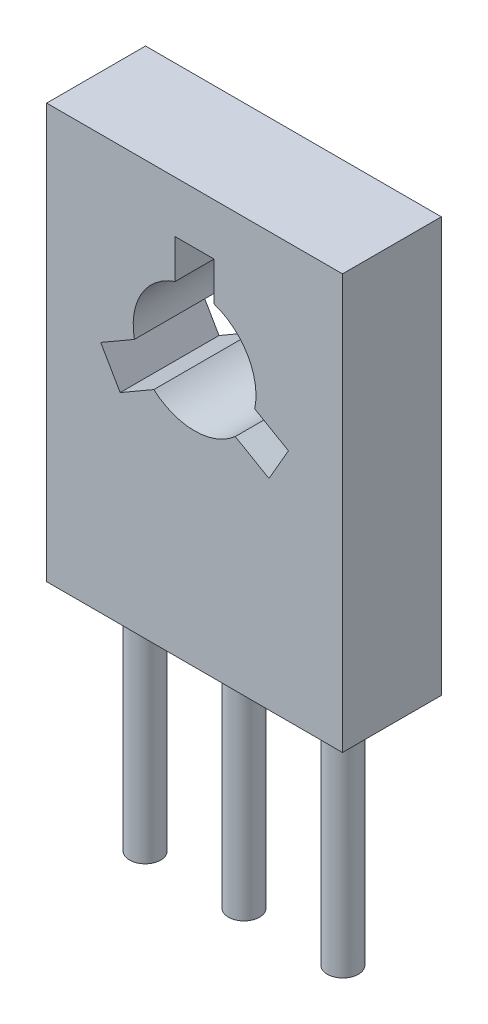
from build123d import *

# Parameters (mm, degrees)
ESQUISSE1_W             = 7.6
ESQUISSE1_H             = 10.65
EXTRUSION1_DEPTH        = 2.54
ENL_V_MAT_EXTRU_1_DEPTH = 28.495084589
ESQUISSE3_R             = 0.4
EXTRUSION2_DEPTH        = 6


with BuildPart() as part:
    # Esquisse1 → Extrusion1 (new body)
    with BuildSketch(Plane.XY):
        with Locations((-18.101179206, 11.102611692)):
            Rectangle(ESQUISSE1_W, ESQUISSE1_H)
    extrude(amount=EXTRUSION1_DEPTH)

    # Esquisse2 → Enl_v. mat.-Extru.1 (cut, through all)
    with BuildSketch(Plane.XY.offset(2.54)):
        with BuildLine():
            Line((-18.601179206, 15.107480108), (-17.601179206, 15.107480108))
            Line((-17.601179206, 15.107480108), (-17.601179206, 14.107480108))
            ThreePointArc((-17.601179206, 14.107480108), (-16.735058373, 13.400088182), (-16.555499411, 12.296309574))
            Line((-16.555499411, 12.296309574), (-15.689474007, 11.796309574))
            Line((-15.689474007, 11.796309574), (-16.189474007, 10.93028417))
            Line((-16.189474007, 10.93028417), (-17.055499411, 11.43028417))
            ThreePointArc((-17.055499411, 11.43028417), (-18.101179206, 11.033897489), (-19.146859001, 11.43028417))
            Line((-19.146859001, 11.43028417), (-20.012884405, 10.93028417))
            Line((-20.012884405, 10.93028417), (-20.512884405, 11.796309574))
            Line((-20.512884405, 11.796309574), (-19.646859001, 12.296309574))
            ThreePointArc((-19.646859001, 12.296309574), (-19.46730004, 13.400088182), (-18.601179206, 14.107480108))
            Line((-18.601179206, 14.107480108), (-18.601179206, 15.107480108))
        make_face()
    extrude(amount=-ENL_V_MAT_EXTRU_1_DEPTH, mode=Mode.SUBTRACT)

    # Esquisse3 → Extrusion2 (add)
    with BuildSketch(Plane.XZ.offset(-5.777611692)):
        with Locations(Location((-18.101179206, 1.27, 0), (0, 0, 90))):
            Circle(ESQUISSE3_R)
        with Locations(Location((-20.641179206, 1.27, 0), (0, 0, 90))):
            Circle(ESQUISSE3_R)
        with Locations(Location((-15.561179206, 1.27, 0), (0, 0, 90))):
            Circle(ESQUISSE3_R)
    extrude(amount=EXTRUSION2_DEPTH)


solid = part.part
